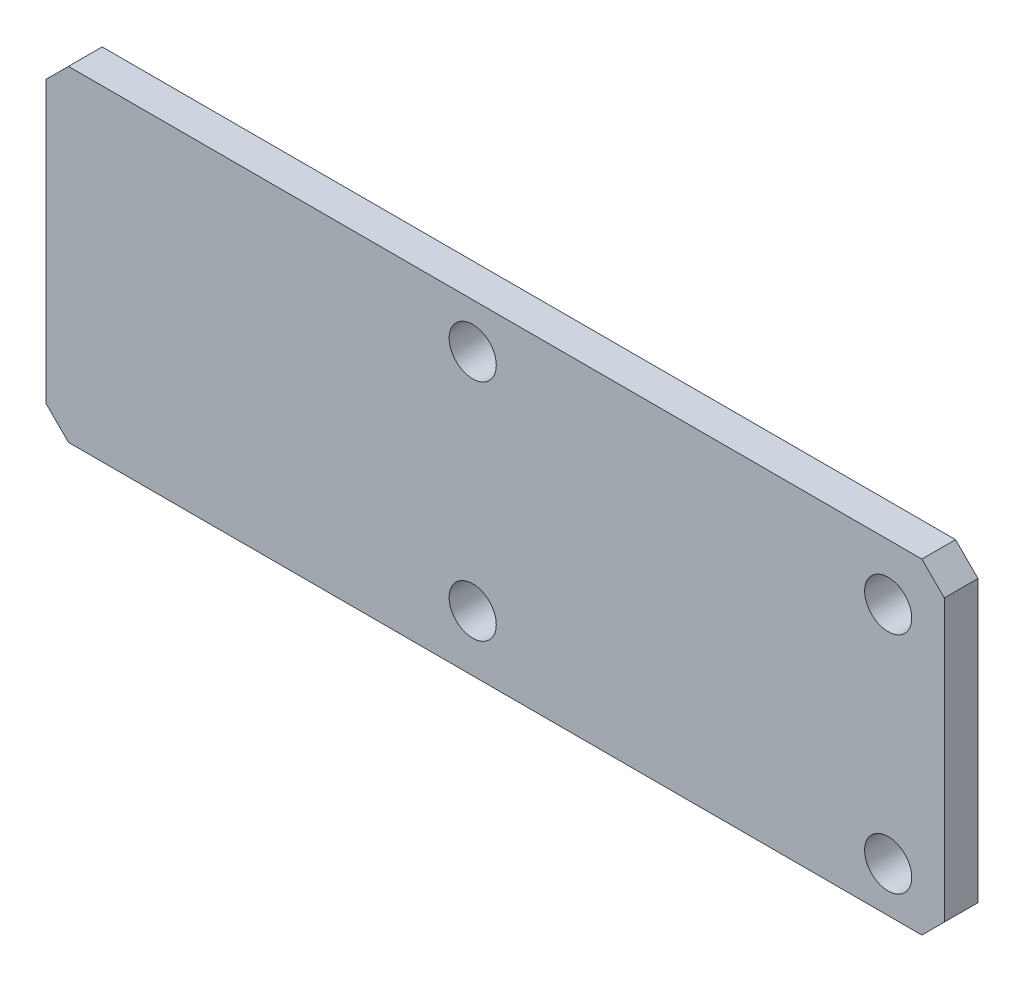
from build123d import *

# Parameters (mm, degrees)
ESQUISSE1_W      = 80
ESQUISSE1_H      = 29
ESQUISSE1_R      = 2.1
EXTRUSION1_DEPTH = 3
CHANFREIN1_SIZE  = 2


with BuildPart() as part:
    # Esquisse1 → Extrusion1 (new body)
    with BuildSketch(Plane.XY):
        with Locations((10, 0.5)):
            Rectangle(ESQUISSE1_W, ESQUISSE1_H)
        with Locations((45, 10)):
            Circle(ESQUISSE1_R, mode=Mode.SUBTRACT)
        with Locations((45, -10)):
            Circle(ESQUISSE1_R, mode=Mode.SUBTRACT)
        with Locations((8, 11)):
            Circle(ESQUISSE1_R, mode=Mode.SUBTRACT)
        with Locations((8, -9)):
            Circle(ESQUISSE1_R, mode=Mode.SUBTRACT)
    extrude(amount=EXTRUSION1_DEPTH)

    # Chanfrein1
    chanfrein1_edges = [part.edges().sort_by_distance(p)[0] for p in [
        (-30, 15, 1.5),
        (50, 15, 1.5),
        (50, -14, 1.5),
        (-30, -14, 1.5),
    ]]
    chamfer(chanfrein1_edges, length=CHANFREIN1_SIZE)


solid = part.part
